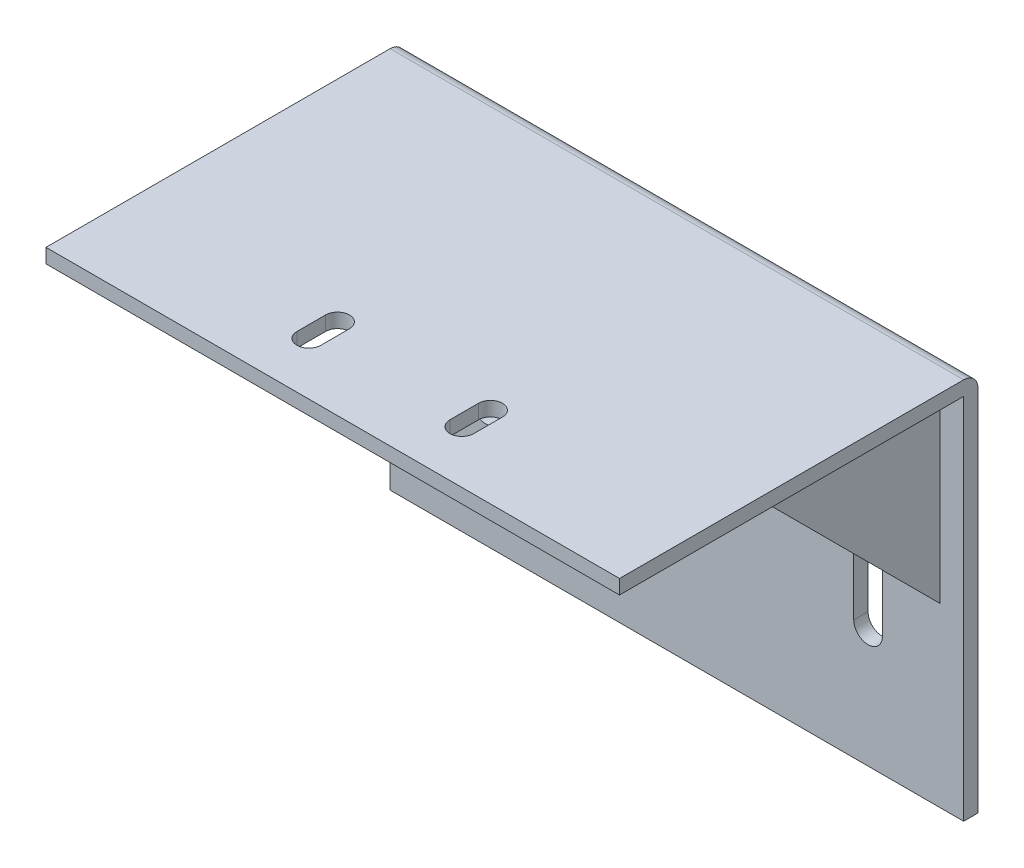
ISO-10303-21;
HEADER;
FILE_DESCRIPTION(('STEP AP214'),'2;1');
FILE_NAME('part.step','',(''),(''),'','','');
FILE_SCHEMA(('AUTOMOTIVE_DESIGN { 1 0 10303 214 1 1 1 1 }'));
ENDSEC;
DATA;
#1=APPLICATION_CONTEXT('core data for automotive mechanical design processes');
#2=APPLICATION_PROTOCOL_DEFINITION('international standard','automotive_design',2000,#1);
#3=PRODUCT_CONTEXT('',#1,'mechanical');
#4=PRODUCT('Part','Part','',(#3));
#5=PRODUCT_RELATED_PRODUCT_CATEGORY('part','',(#4));
#6=PRODUCT_DEFINITION_FORMATION('','',#4);
#7=PRODUCT_DEFINITION_CONTEXT('part definition',#1,'design');
#8=PRODUCT_DEFINITION('design','',#6,#7);
#9=PRODUCT_DEFINITION_SHAPE('','',#8);
#10=(LENGTH_UNIT() NAMED_UNIT(*) SI_UNIT(.MILLI.,.METRE.));
#11=(NAMED_UNIT(*) PLANE_ANGLE_UNIT() SI_UNIT($,.RADIAN.));
#12=(NAMED_UNIT(*) SI_UNIT($,.STERADIAN.) SOLID_ANGLE_UNIT());
#13=UNCERTAINTY_MEASURE_WITH_UNIT(LENGTH_MEASURE(1.E-05),#10,'distance_accuracy_value','');
#14=(GEOMETRIC_REPRESENTATION_CONTEXT(3) GLOBAL_UNCERTAINTY_ASSIGNED_CONTEXT((#13)) GLOBAL_UNIT_ASSIGNED_CONTEXT((#10,
#11,#12)) REPRESENTATION_CONTEXT('',''));
#15=CARTESIAN_POINT('',(0.,0.,0.));
#16=DIRECTION('',(0.,0.,1.));
#17=DIRECTION('',(1.,0.,0.));
#18=AXIS2_PLACEMENT_3D('',#15,#16,#17);
#19=CARTESIAN_POINT('',(0.,0.,3.));
#20=DIRECTION('',(0.,0.,-1.));
#21=DIRECTION('',(-1.,0.,0.));
#22=AXIS2_PLACEMENT_3D('',#19,#20,#21);
#23=PLANE('',#22);
#24=CARTESIAN_POINT('',(20.,25.,3.));
#25=DIRECTION('',(0.,0.,1.));
#26=DIRECTION('',(1.,0.,0.));
#27=AXIS2_PLACEMENT_3D('',#24,#25,#26);
#28=CIRCLE('',#27,3.);
#29=CARTESIAN_POINT('',(17.,25.,3.));
#30=VERTEX_POINT('',#29);
#31=CARTESIAN_POINT('',(23.,25.,3.));
#32=VERTEX_POINT('',#31);
#33=EDGE_CURVE('E279',#30,#32,#28,.T.);
#34=ORIENTED_EDGE('',*,*,#33,.F.);
#35=DIRECTION('',(0.,-1.,0.));
#36=VECTOR('',#35,1.);
#37=CARTESIAN_POINT('',(17.,55.,3.));
#38=LINE('',#37,#36);
#39=CARTESIAN_POINT('',(17.,55.,3.));
#40=VERTEX_POINT('',#39);
#41=EDGE_CURVE('E277',#40,#30,#38,.T.);
#42=ORIENTED_EDGE('',*,*,#41,.F.);
#43=CARTESIAN_POINT('',(20.,55.,3.));
#44=DIRECTION('',(0.,0.,1.));
#45=DIRECTION('',(1.,0.,0.));
#46=AXIS2_PLACEMENT_3D('',#43,#44,#45);
#47=CIRCLE('',#46,2.99999999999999);
#48=CARTESIAN_POINT('',(23.,55.,3.));
#49=VERTEX_POINT('',#48);
#50=EDGE_CURVE('E268',#49,#40,#47,.T.);
#51=ORIENTED_EDGE('',*,*,#50,.F.);
#52=DIRECTION('',(0.,1.,0.));
#53=VECTOR('',#52,1.);
#54=CARTESIAN_POINT('',(23.,55.,3.));
#55=LINE('',#54,#53);
#56=EDGE_CURVE('E282',#32,#49,#55,.T.);
#57=ORIENTED_EDGE('',*,*,#56,.F.);
#58=EDGE_LOOP('',(#34,#42,#51,#57));
#59=FACE_BOUND('',#58,.T.);
#60=CARTESIAN_POINT('',(100.,25.,3.));
#61=DIRECTION('',(0.,0.,1.));
#62=DIRECTION('',(1.,0.,0.));
#63=AXIS2_PLACEMENT_3D('',#60,#61,#62);
#64=CIRCLE('',#63,3.);
#65=CARTESIAN_POINT('',(97.,25.,3.));
#66=VERTEX_POINT('',#65);
#67=CARTESIAN_POINT('',(103.,24.9999999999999,3.));
#68=VERTEX_POINT('',#67);
#69=EDGE_CURVE('E247',#66,#68,#64,.T.);
#70=ORIENTED_EDGE('',*,*,#69,.F.);
#71=DIRECTION('',(0.,-1.,0.));
#72=VECTOR('',#71,1.);
#73=CARTESIAN_POINT('',(97.,55.,3.));
#74=LINE('',#73,#72);
#75=CARTESIAN_POINT('',(97.,55.,3.));
#76=VERTEX_POINT('',#75);
#77=EDGE_CURVE('E245',#76,#66,#74,.T.);
#78=ORIENTED_EDGE('',*,*,#77,.F.);
#79=CARTESIAN_POINT('',(100.,55.,3.));
#80=DIRECTION('',(0.,0.,1.));
#81=DIRECTION('',(1.,0.,0.));
#82=AXIS2_PLACEMENT_3D('',#79,#80,#81);
#83=CIRCLE('',#82,3.);
#84=CARTESIAN_POINT('',(103.,55.,3.));
#85=VERTEX_POINT('',#84);
#86=EDGE_CURVE('E240',#85,#76,#83,.T.);
#87=ORIENTED_EDGE('',*,*,#86,.F.);
#88=DIRECTION('',(0.,1.,0.));
#89=VECTOR('',#88,1.);
#90=CARTESIAN_POINT('',(103.,55.,3.));
#91=LINE('',#90,#89);
#92=EDGE_CURVE('E250',#68,#85,#91,.T.);
#93=ORIENTED_EDGE('',*,*,#92,.F.);
#94=EDGE_LOOP('',(#70,#78,#87,#93));
#95=FACE_BOUND('',#94,.T.);
#96=DIRECTION('',(0.,1.,0.));
#97=VECTOR('',#96,1.);
#98=CARTESIAN_POINT('',(115.,77.,3.));
#99=LINE('',#98,#97);
#100=CARTESIAN_POINT('',(115.,37.,3.));
#101=VERTEX_POINT('',#100);
#102=CARTESIAN_POINT('',(115.,77.,3.));
#103=VERTEX_POINT('',#102);
#104=EDGE_CURVE('E398',#101,#103,#99,.T.);
#105=ORIENTED_EDGE('',*,*,#104,.F.);
#106=DIRECTION('',(1.,0.,0.));
#107=VECTOR('',#106,1.);
#108=CARTESIAN_POINT('',(112.,37.,3.));
#109=LINE('',#108,#107);
#110=CARTESIAN_POINT('',(112.,37.,3.));
#111=VERTEX_POINT('',#110);
#112=EDGE_CURVE('E458',#111,#101,#109,.T.);
#113=ORIENTED_EDGE('',*,*,#112,.F.);
#114=DIRECTION('',(0.,-1.,0.));
#115=VECTOR('',#114,1.);
#116=CARTESIAN_POINT('',(112.,77.,3.));
#117=LINE('',#116,#115);
#118=CARTESIAN_POINT('',(112.,77.,3.));
#119=VERTEX_POINT('',#118);
#120=EDGE_CURVE('E452',#119,#111,#117,.T.);
#121=ORIENTED_EDGE('',*,*,#120,.F.);
#122=DIRECTION('',(1.,0.,0.));
#123=VECTOR('',#122,1.);
#124=CARTESIAN_POINT('',(0.,77.,3.));
#125=LINE('',#124,#123);
#126=CARTESIAN_POINT('',(8.,77.,3.));
#127=VERTEX_POINT('',#126);
#128=EDGE_CURVE('E319',#127,#119,#125,.T.);
#129=ORIENTED_EDGE('',*,*,#128,.F.);
#130=DIRECTION('',(0.,1.,0.));
#131=VECTOR('',#130,1.);
#132=CARTESIAN_POINT('',(8.,77.,3.));
#133=LINE('',#132,#131);
#134=CARTESIAN_POINT('',(8.00000000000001,37.,3.));
#135=VERTEX_POINT('',#134);
#136=EDGE_CURVE('E225',#135,#127,#133,.T.);
#137=ORIENTED_EDGE('',*,*,#136,.F.);
#138=DIRECTION('',(1.,0.,0.));
#139=VECTOR('',#138,1.);
#140=CARTESIAN_POINT('',(4.99999999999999,37.,3.));
#141=LINE('',#140,#139);
#142=CARTESIAN_POINT('',(4.99999999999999,37.,3.));
#143=VERTEX_POINT('',#142);
#144=EDGE_CURVE('E467',#143,#135,#141,.T.);
#145=ORIENTED_EDGE('',*,*,#144,.F.);
#146=DIRECTION('',(0.,-1.,0.));
#147=VECTOR('',#146,1.);
#148=CARTESIAN_POINT('',(4.99999999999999,77.,3.));
#149=LINE('',#148,#147);
#150=CARTESIAN_POINT('',(4.99999999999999,77.,3.));
#151=VERTEX_POINT('',#150);
#152=EDGE_CURVE('E230',#151,#143,#149,.T.);
#153=ORIENTED_EDGE('',*,*,#152,.F.);
#154=CARTESIAN_POINT('',(0.,77.,3.));
#155=VERTEX_POINT('',#154);
#156=EDGE_CURVE('E237',#155,#151,#125,.T.);
#157=ORIENTED_EDGE('',*,*,#156,.F.);
#158=DIRECTION('',(0.,-1.,0.));
#159=VECTOR('',#158,1.);
#160=CARTESIAN_POINT('',(0.,0.,3.));
#161=LINE('',#160,#159);
#162=CARTESIAN_POINT('',(0.,0.,3.));
#163=VERTEX_POINT('',#162);
#164=EDGE_CURVE('E344',#155,#163,#161,.T.);
#165=ORIENTED_EDGE('',*,*,#164,.T.);
#166=DIRECTION('',(1.,0.,0.));
#167=VECTOR('',#166,1.);
#168=CARTESIAN_POINT('',(0.,0.,3.));
#169=LINE('',#168,#167);
#170=CARTESIAN_POINT('',(120.,0.,3.));
#171=VERTEX_POINT('',#170);
#172=EDGE_CURVE('E346',#163,#171,#169,.T.);
#173=ORIENTED_EDGE('',*,*,#172,.T.);
#174=DIRECTION('',(0.,1.,0.));
#175=VECTOR('',#174,1.);
#176=CARTESIAN_POINT('',(120.,0.,3.));
#177=LINE('',#176,#175);
#178=CARTESIAN_POINT('',(120.,77.,3.));
#179=VERTEX_POINT('',#178);
#180=EDGE_CURVE('E348',#171,#179,#177,.T.);
#181=ORIENTED_EDGE('',*,*,#180,.T.);
#182=EDGE_CURVE('E300',#103,#179,#125,.T.);
#183=ORIENTED_EDGE('',*,*,#182,.F.);
#184=EDGE_LOOP('',(#105,#113,#121,#129,#137,#145,#153,#157,#165,#173,#181,#183));
#185=FACE_BOUND('',#184,.T.);
#186=ADVANCED_FACE('F24',(#59,#95,#185),#23,.F.);
#187=CARTESIAN_POINT('',(0.,77.,75.));
#188=DIRECTION('',(0.,1.,0.));
#189=DIRECTION('',(-1.,0.,0.));
#190=AXIS2_PLACEMENT_3D('',#187,#188,#189);
#191=PLANE('',#190);
#192=DIRECTION('',(0.,0.,-1.));
#193=VECTOR('',#192,1.);
#194=CARTESIAN_POINT('',(41.5,77.,64.));
#195=LINE('',#194,#193);
#196=CARTESIAN_POINT('',(41.5,77.,64.));
#197=VERTEX_POINT('',#196);
#198=CARTESIAN_POINT('',(41.5,77.,58.));
#199=VERTEX_POINT('',#198);
#200=EDGE_CURVE('E677',#197,#199,#195,.T.);
#201=ORIENTED_EDGE('',*,*,#200,.F.);
#202=CARTESIAN_POINT('',(44.,77.,64.));
#203=DIRECTION('',(0.,-1.,0.));
#204=DIRECTION('',(1.,0.,0.));
#205=AXIS2_PLACEMENT_3D('',#202,#203,#204);
#206=CIRCLE('',#205,2.5);
#207=CARTESIAN_POINT('',(46.5,77.,64.));
#208=VERTEX_POINT('',#207);
#209=EDGE_CURVE('E674',#208,#197,#206,.T.);
#210=ORIENTED_EDGE('',*,*,#209,.F.);
#211=DIRECTION('',(0.,0.,1.));
#212=VECTOR('',#211,1.);
#213=CARTESIAN_POINT('',(46.5,77.,64.));
#214=LINE('',#213,#212);
#215=CARTESIAN_POINT('',(46.5,77.,58.));
#216=VERTEX_POINT('',#215);
#217=EDGE_CURVE('E663',#216,#208,#214,.T.);
#218=ORIENTED_EDGE('',*,*,#217,.F.);
#219=CARTESIAN_POINT('',(44.,77.,58.));
#220=DIRECTION('',(0.,-1.,0.));
#221=DIRECTION('',(1.,0.,0.));
#222=AXIS2_PLACEMENT_3D('',#219,#220,#221);
#223=CIRCLE('',#222,2.5);
#224=EDGE_CURVE('E671',#199,#216,#223,.T.);
#225=ORIENTED_EDGE('',*,*,#224,.F.);
#226=EDGE_LOOP('',(#201,#210,#218,#225));
#227=FACE_BOUND('',#226,.T.);
#228=DIRECTION('',(0.,0.,-1.));
#229=VECTOR('',#228,1.);
#230=CARTESIAN_POINT('',(73.5,77.,64.));
#231=LINE('',#230,#229);
#232=CARTESIAN_POINT('',(73.5,77.,64.));
#233=VERTEX_POINT('',#232);
#234=CARTESIAN_POINT('',(73.5,77.,58.));
#235=VERTEX_POINT('',#234);
#236=EDGE_CURVE('E700',#233,#235,#231,.T.);
#237=ORIENTED_EDGE('',*,*,#236,.F.);
#238=CARTESIAN_POINT('',(76.,77.,64.));
#239=DIRECTION('',(0.,-1.,0.));
#240=DIRECTION('',(1.,0.,0.));
#241=AXIS2_PLACEMENT_3D('',#238,#239,#240);
#242=CIRCLE('',#241,2.50000000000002);
#243=CARTESIAN_POINT('',(78.5,77.,64.));
#244=VERTEX_POINT('',#243);
#245=EDGE_CURVE('E694',#244,#233,#242,.T.);
#246=ORIENTED_EDGE('',*,*,#245,.F.);
#247=DIRECTION('',(0.,0.,1.));
#248=VECTOR('',#247,1.);
#249=CARTESIAN_POINT('',(78.5,77.,64.));
#250=LINE('',#249,#248);
#251=CARTESIAN_POINT('',(78.5,77.,58.));
#252=VERTEX_POINT('',#251);
#253=EDGE_CURVE('E705',#252,#244,#250,.T.);
#254=ORIENTED_EDGE('',*,*,#253,.F.);
#255=CARTESIAN_POINT('',(76.,77.,58.));
#256=DIRECTION('',(0.,-1.,0.));
#257=DIRECTION('',(1.,0.,0.));
#258=AXIS2_PLACEMENT_3D('',#255,#256,#257);
#259=CIRCLE('',#258,2.50000000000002);
#260=EDGE_CURVE('E703',#235,#252,#259,.T.);
#261=ORIENTED_EDGE('',*,*,#260,.F.);
#262=EDGE_LOOP('',(#237,#246,#254,#261));
#263=FACE_BOUND('',#262,.T.);
#264=DIRECTION('',(-1.,0.,0.));
#265=VECTOR('',#264,1.);
#266=CARTESIAN_POINT('',(4.99999999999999,77.,43.));
#267=LINE('',#266,#265);
#268=CARTESIAN_POINT('',(8.,77.,43.));
#269=VERTEX_POINT('',#268);
#270=CARTESIAN_POINT('',(4.99999999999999,77.,43.));
#271=VERTEX_POINT('',#270);
#272=EDGE_CURVE('E213',#269,#271,#267,.T.);
#273=ORIENTED_EDGE('',*,*,#272,.F.);
#274=DIRECTION('',(0.,0.,-1.));
#275=VECTOR('',#274,1.);
#276=CARTESIAN_POINT('',(8.,77.,43.));
#277=LINE('',#276,#275);
#278=EDGE_CURVE('E238',#269,#127,#277,.T.);
#279=ORIENTED_EDGE('',*,*,#278,.T.);
#280=ORIENTED_EDGE('',*,*,#128,.T.);
#281=DIRECTION('',(0.,0.,-1.));
#282=VECTOR('',#281,1.);
#283=CARTESIAN_POINT('',(112.,77.,43.));
#284=LINE('',#283,#282);
#285=CARTESIAN_POINT('',(112.,77.,43.));
#286=VERTEX_POINT('',#285);
#287=EDGE_CURVE('E463',#286,#119,#284,.T.);
#288=ORIENTED_EDGE('',*,*,#287,.F.);
#289=DIRECTION('',(-1.,0.,0.));
#290=VECTOR('',#289,1.);
#291=CARTESIAN_POINT('',(112.,77.,43.));
#292=LINE('',#291,#290);
#293=CARTESIAN_POINT('',(115.,77.,43.));
#294=VERTEX_POINT('',#293);
#295=EDGE_CURVE('E461',#294,#286,#292,.T.);
#296=ORIENTED_EDGE('',*,*,#295,.F.);
#297=DIRECTION('',(0.,0.,-1.));
#298=VECTOR('',#297,1.);
#299=CARTESIAN_POINT('',(115.,77.,43.));
#300=LINE('',#299,#298);
#301=EDGE_CURVE('E394',#294,#103,#300,.T.);
#302=ORIENTED_EDGE('',*,*,#301,.T.);
#303=ORIENTED_EDGE('',*,*,#182,.T.);
#304=DIRECTION('',(0.,0.,-1.));
#305=VECTOR('',#304,1.);
#306=CARTESIAN_POINT('',(120.,77.,75.));
#307=LINE('',#306,#305);
#308=CARTESIAN_POINT('',(120.,77.,75.));
#309=VERTEX_POINT('',#308);
#310=EDGE_CURVE('E377',#309,#179,#307,.T.);
#311=ORIENTED_EDGE('',*,*,#310,.F.);
#312=DIRECTION('',(1.,0.,0.));
#313=VECTOR('',#312,1.);
#314=CARTESIAN_POINT('',(0.,77.,75.));
#315=LINE('',#314,#313);
#316=CARTESIAN_POINT('',(0.,77.,75.));
#317=VERTEX_POINT('',#316);
#318=EDGE_CURVE('E379',#317,#309,#315,.T.);
#319=ORIENTED_EDGE('',*,*,#318,.F.);
#320=DIRECTION('',(0.,0.,-1.));
#321=VECTOR('',#320,1.);
#322=CARTESIAN_POINT('',(0.,77.,75.));
#323=LINE('',#322,#321);
#324=EDGE_CURVE('E373',#317,#155,#323,.T.);
#325=ORIENTED_EDGE('',*,*,#324,.T.);
#326=ORIENTED_EDGE('',*,*,#156,.T.);
#327=DIRECTION('',(0.,0.,-1.));
#328=VECTOR('',#327,1.);
#329=CARTESIAN_POINT('',(4.99999999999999,77.,43.));
#330=LINE('',#329,#328);
#331=EDGE_CURVE('E224',#271,#151,#330,.T.);
#332=ORIENTED_EDGE('',*,*,#331,.F.);
#333=EDGE_LOOP('',(#273,#279,#280,#288,#296,#302,#303,#311,#319,#325,#326,#332));
#334=FACE_BOUND('',#333,.T.);
#335=ADVANCED_FACE('F235',(#227,#263,#334),#191,.F.);
#336=CARTESIAN_POINT('',(0.,0.,3.));
#337=DIRECTION('',(1.,0.,0.));
#338=DIRECTION('',(0.,0.,-1.));
#339=AXIS2_PLACEMENT_3D('',#336,#337,#338);
#340=PLANE('',#339);
#341=DIRECTION('',(0.,0.,-1.));
#342=VECTOR('',#341,1.);
#343=CARTESIAN_POINT('',(0.,80.,3.));
#344=LINE('',#343,#342);
#345=CARTESIAN_POINT('',(0.,80.,75.));
#346=VERTEX_POINT('',#345);
#347=CARTESIAN_POINT('',(0.,80.,3.));
#348=VERTEX_POINT('',#347);
#349=EDGE_CURVE('E356',#346,#348,#344,.T.);
#350=ORIENTED_EDGE('',*,*,#349,.T.);
#351=CARTESIAN_POINT('',(0.,77.,3.));
#352=DIRECTION('',(1.,0.,0.));
#353=DIRECTION('',(0.,0.,-1.));
#354=AXIS2_PLACEMENT_3D('',#351,#352,#353);
#355=CIRCLE('',#354,3.);
#356=CARTESIAN_POINT('',(0.,77.,0.));
#357=VERTEX_POINT('',#356);
#358=EDGE_CURVE('E46',#348,#357,#355,.F.);
#359=ORIENTED_EDGE('',*,*,#358,.T.);
#360=DIRECTION('',(0.,-1.,0.));
#361=VECTOR('',#360,1.);
#362=CARTESIAN_POINT('',(0.,0.,0.));
#363=LINE('',#362,#361);
#364=CARTESIAN_POINT('',(0.,0.,0.));
#365=VERTEX_POINT('',#364);
#366=EDGE_CURVE('E372',#357,#365,#363,.T.);
#367=ORIENTED_EDGE('',*,*,#366,.T.);
#368=DIRECTION('',(0.,0.,-1.));
#369=VECTOR('',#368,1.);
#370=CARTESIAN_POINT('',(0.,0.,3.));
#371=LINE('',#370,#369);
#372=EDGE_CURVE('E329',#163,#365,#371,.T.);
#373=ORIENTED_EDGE('',*,*,#372,.F.);
#374=ORIENTED_EDGE('',*,*,#164,.F.);
#375=ORIENTED_EDGE('',*,*,#324,.F.);
#376=DIRECTION('',(0.,-1.,0.));
#377=VECTOR('',#376,1.);
#378=CARTESIAN_POINT('',(0.,80.,75.));
#379=LINE('',#378,#377);
#380=EDGE_CURVE('E310',#346,#317,#379,.T.);
#381=ORIENTED_EDGE('',*,*,#380,.F.);
#382=EDGE_LOOP('',(#350,#359,#367,#373,#374,#375,#381));
#383=FACE_BOUND('',#382,.T.);
#384=ADVANCED_FACE('F26',(#383),#340,.F.);
#385=CARTESIAN_POINT('',(0.,0.,3.));
#386=DIRECTION('',(0.,1.,0.));
#387=DIRECTION('',(0.,0.,1.));
#388=AXIS2_PLACEMENT_3D('',#385,#386,#387);
#389=PLANE('',#388);
#390=DIRECTION('',(1.,0.,0.));
#391=VECTOR('',#390,1.);
#392=CARTESIAN_POINT('',(0.,0.,0.));
#393=LINE('',#392,#391);
#394=CARTESIAN_POINT('',(120.,0.,0.));
#395=VERTEX_POINT('',#394);
#396=EDGE_CURVE('E371',#365,#395,#393,.T.);
#397=ORIENTED_EDGE('',*,*,#396,.T.);
#398=DIRECTION('',(0.,0.,-1.));
#399=VECTOR('',#398,1.);
#400=CARTESIAN_POINT('',(120.,0.,3.));
#401=LINE('',#400,#399);
#402=EDGE_CURVE('E334',#171,#395,#401,.T.);
#403=ORIENTED_EDGE('',*,*,#402,.F.);
#404=ORIENTED_EDGE('',*,*,#172,.F.);
#405=ORIENTED_EDGE('',*,*,#372,.T.);
#406=EDGE_LOOP('',(#397,#403,#404,#405));
#407=FACE_BOUND('',#406,.T.);
#408=ADVANCED_FACE('F399',(#407),#389,.F.);
#409=CARTESIAN_POINT('',(120.,0.,3.));
#410=DIRECTION('',(-1.,0.,0.));
#411=DIRECTION('',(0.,0.,1.));
#412=AXIS2_PLACEMENT_3D('',#409,#410,#411);
#413=PLANE('',#412);
#414=DIRECTION('',(0.,1.,0.));
#415=VECTOR('',#414,1.);
#416=CARTESIAN_POINT('',(120.,0.,0.));
#417=LINE('',#416,#415);
#418=CARTESIAN_POINT('',(120.,77.,0.));
#419=VERTEX_POINT('',#418);
#420=EDGE_CURVE('E347',#395,#419,#417,.T.);
#421=ORIENTED_EDGE('',*,*,#420,.T.);
#422=CARTESIAN_POINT('',(120.,77.,3.));
#423=DIRECTION('',(-1.,0.,0.));
#424=DIRECTION('',(0.,0.,1.));
#425=AXIS2_PLACEMENT_3D('',#422,#423,#424);
#426=CIRCLE('',#425,3.);
#427=CARTESIAN_POINT('',(120.,80.,3.));
#428=VERTEX_POINT('',#427);
#429=EDGE_CURVE('E11',#419,#428,#426,.F.);
#430=ORIENTED_EDGE('',*,*,#429,.T.);
#431=DIRECTION('',(0.,0.,-1.));
#432=VECTOR('',#431,1.);
#433=CARTESIAN_POINT('',(120.,80.,3.));
#434=LINE('',#433,#432);
#435=CARTESIAN_POINT('',(120.,80.,75.));
#436=VERTEX_POINT('',#435);
#437=EDGE_CURVE('E340',#436,#428,#434,.T.);
#438=ORIENTED_EDGE('',*,*,#437,.F.);
#439=DIRECTION('',(0.,1.,0.));
#440=VECTOR('',#439,1.);
#441=CARTESIAN_POINT('',(120.,80.,75.));
#442=LINE('',#441,#440);
#443=EDGE_CURVE('E378',#309,#436,#442,.T.);
#444=ORIENTED_EDGE('',*,*,#443,.F.);
#445=ORIENTED_EDGE('',*,*,#310,.T.);
#446=ORIENTED_EDGE('',*,*,#180,.F.);
#447=ORIENTED_EDGE('',*,*,#402,.T.);
#448=EDGE_LOOP('',(#421,#430,#438,#444,#445,#446,#447));
#449=FACE_BOUND('',#448,.T.);
#450=ADVANCED_FACE('F367',(#449),#413,.F.);
#451=CARTESIAN_POINT('',(0.,80.,3.));
#452=DIRECTION('',(0.,-1.,0.));
#453=DIRECTION('',(1.,0.,0.));
#454=AXIS2_PLACEMENT_3D('',#451,#452,#453);
#455=PLANE('',#454);
#456=DIRECTION('',(0.,0.,1.));
#457=VECTOR('',#456,1.);
#458=CARTESIAN_POINT('',(46.5,80.,64.));
#459=LINE('',#458,#457);
#460=CARTESIAN_POINT('',(46.5,80.,58.));
#461=VERTEX_POINT('',#460);
#462=CARTESIAN_POINT('',(46.5,80.,64.));
#463=VERTEX_POINT('',#462);
#464=EDGE_CURVE('E430',#461,#463,#459,.T.);
#465=ORIENTED_EDGE('',*,*,#464,.T.);
#466=CARTESIAN_POINT('',(44.,80.,64.));
#467=DIRECTION('',(0.,-1.,0.));
#468=DIRECTION('',(1.,0.,0.));
#469=AXIS2_PLACEMENT_3D('',#466,#467,#468);
#470=CIRCLE('',#469,2.5);
#471=CARTESIAN_POINT('',(41.5,80.,64.));
#472=VERTEX_POINT('',#471);
#473=EDGE_CURVE('E670',#463,#472,#470,.T.);
#474=ORIENTED_EDGE('',*,*,#473,.T.);
#475=DIRECTION('',(0.,0.,-1.));
#476=VECTOR('',#475,1.);
#477=CARTESIAN_POINT('',(41.5,80.,64.));
#478=LINE('',#477,#476);
#479=CARTESIAN_POINT('',(41.5,80.,58.));
#480=VERTEX_POINT('',#479);
#481=EDGE_CURVE('E686',#472,#480,#478,.T.);
#482=ORIENTED_EDGE('',*,*,#481,.T.);
#483=CARTESIAN_POINT('',(44.,80.,58.));
#484=DIRECTION('',(0.,-1.,0.));
#485=DIRECTION('',(1.,0.,0.));
#486=AXIS2_PLACEMENT_3D('',#483,#484,#485);
#487=CIRCLE('',#486,2.5);
#488=EDGE_CURVE('E689',#480,#461,#487,.T.);
#489=ORIENTED_EDGE('',*,*,#488,.T.);
#490=EDGE_LOOP('',(#465,#474,#482,#489));
#491=FACE_BOUND('',#490,.T.);
#492=DIRECTION('',(0.,0.,1.));
#493=VECTOR('',#492,1.);
#494=CARTESIAN_POINT('',(78.5,80.,64.));
#495=LINE('',#494,#493);
#496=CARTESIAN_POINT('',(78.5,80.,58.));
#497=VERTEX_POINT('',#496);
#498=CARTESIAN_POINT('',(78.5,80.,64.));
#499=VERTEX_POINT('',#498);
#500=EDGE_CURVE('E435',#497,#499,#495,.T.);
#501=ORIENTED_EDGE('',*,*,#500,.T.);
#502=CARTESIAN_POINT('',(76.,80.,64.));
#503=DIRECTION('',(0.,-1.,0.));
#504=DIRECTION('',(1.,0.,0.));
#505=AXIS2_PLACEMENT_3D('',#502,#503,#504);
#506=CIRCLE('',#505,2.50000000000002);
#507=CARTESIAN_POINT('',(73.5,80.,64.));
#508=VERTEX_POINT('',#507);
#509=EDGE_CURVE('E438',#499,#508,#506,.T.);
#510=ORIENTED_EDGE('',*,*,#509,.T.);
#511=DIRECTION('',(0.,0.,-1.));
#512=VECTOR('',#511,1.);
#513=CARTESIAN_POINT('',(73.5,80.,64.));
#514=LINE('',#513,#512);
#515=CARTESIAN_POINT('',(73.5,80.,58.));
#516=VERTEX_POINT('',#515);
#517=EDGE_CURVE('E446',#508,#516,#514,.T.);
#518=ORIENTED_EDGE('',*,*,#517,.T.);
#519=CARTESIAN_POINT('',(76.,80.,58.));
#520=DIRECTION('',(0.,-1.,0.));
#521=DIRECTION('',(1.,0.,0.));
#522=AXIS2_PLACEMENT_3D('',#519,#520,#521);
#523=CIRCLE('',#522,2.50000000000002);
#524=EDGE_CURVE('E439',#516,#497,#523,.T.);
#525=ORIENTED_EDGE('',*,*,#524,.T.);
#526=EDGE_LOOP('',(#501,#510,#518,#525));
#527=FACE_BOUND('',#526,.T.);
#528=ORIENTED_EDGE('',*,*,#437,.T.);
#529=DIRECTION('',(-1.,0.,0.));
#530=VECTOR('',#529,1.);
#531=CARTESIAN_POINT('',(0.,80.,3.));
#532=LINE('',#531,#530);
#533=EDGE_CURVE('E326',#428,#348,#532,.T.);
#534=ORIENTED_EDGE('',*,*,#533,.T.);
#535=ORIENTED_EDGE('',*,*,#349,.F.);
#536=DIRECTION('',(-1.,0.,0.));
#537=VECTOR('',#536,1.);
#538=CARTESIAN_POINT('',(0.,80.,75.));
#539=LINE('',#538,#537);
#540=EDGE_CURVE('E360',#436,#346,#539,.T.);
#541=ORIENTED_EDGE('',*,*,#540,.F.);
#542=EDGE_LOOP('',(#528,#534,#535,#541));
#543=FACE_BOUND('',#542,.T.);
#544=ADVANCED_FACE('F358',(#491,#527,#543),#455,.F.);
#545=CARTESIAN_POINT('',(0.,0.,0.));
#546=DIRECTION('',(0.,0.,-1.));
#547=DIRECTION('',(-1.,0.,0.));
#548=AXIS2_PLACEMENT_3D('',#545,#546,#547);
#549=PLANE('',#548);
#550=CARTESIAN_POINT('',(100.,55.,0.));
#551=DIRECTION('',(0.,0.,1.));
#552=DIRECTION('',(1.,0.,0.));
#553=AXIS2_PLACEMENT_3D('',#550,#551,#552);
#554=CIRCLE('',#553,3.);
#555=CARTESIAN_POINT('',(103.,55.,0.));
#556=VERTEX_POINT('',#555);
#557=CARTESIAN_POINT('',(97.,55.,0.));
#558=VERTEX_POINT('',#557);
#559=EDGE_CURVE('E252',#556,#558,#554,.T.);
#560=ORIENTED_EDGE('',*,*,#559,.T.);
#561=DIRECTION('',(0.,-1.,0.));
#562=VECTOR('',#561,1.);
#563=CARTESIAN_POINT('',(97.,55.,0.));
#564=LINE('',#563,#562);
#565=CARTESIAN_POINT('',(97.,25.,0.));
#566=VERTEX_POINT('',#565);
#567=EDGE_CURVE('E255',#558,#566,#564,.T.);
#568=ORIENTED_EDGE('',*,*,#567,.T.);
#569=CARTESIAN_POINT('',(100.,25.,0.));
#570=DIRECTION('',(0.,0.,1.));
#571=DIRECTION('',(1.,0.,0.));
#572=AXIS2_PLACEMENT_3D('',#569,#570,#571);
#573=CIRCLE('',#572,3.);
#574=CARTESIAN_POINT('',(103.,24.9999999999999,0.));
#575=VERTEX_POINT('',#574);
#576=EDGE_CURVE('E258',#566,#575,#573,.T.);
#577=ORIENTED_EDGE('',*,*,#576,.T.);
#578=DIRECTION('',(0.,1.,0.));
#579=VECTOR('',#578,1.);
#580=CARTESIAN_POINT('',(103.,55.,0.));
#581=LINE('',#580,#579);
#582=EDGE_CURVE('E261',#575,#556,#581,.T.);
#583=ORIENTED_EDGE('',*,*,#582,.T.);
#584=EDGE_LOOP('',(#560,#568,#577,#583));
#585=FACE_BOUND('',#584,.T.);
#586=CARTESIAN_POINT('',(20.,55.,0.));
#587=DIRECTION('',(0.,0.,1.));
#588=DIRECTION('',(1.,0.,0.));
#589=AXIS2_PLACEMENT_3D('',#586,#587,#588);
#590=CIRCLE('',#589,2.99999999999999);
#591=CARTESIAN_POINT('',(23.,55.,0.));
#592=VERTEX_POINT('',#591);
#593=CARTESIAN_POINT('',(17.,55.,0.));
#594=VERTEX_POINT('',#593);
#595=EDGE_CURVE('E284',#592,#594,#590,.T.);
#596=ORIENTED_EDGE('',*,*,#595,.T.);
#597=DIRECTION('',(0.,-1.,0.));
#598=VECTOR('',#597,1.);
#599=CARTESIAN_POINT('',(17.,55.,0.));
#600=LINE('',#599,#598);
#601=CARTESIAN_POINT('',(17.,25.,0.));
#602=VERTEX_POINT('',#601);
#603=EDGE_CURVE('E287',#594,#602,#600,.T.);
#604=ORIENTED_EDGE('',*,*,#603,.T.);
#605=CARTESIAN_POINT('',(20.,25.,0.));
#606=DIRECTION('',(0.,0.,1.));
#607=DIRECTION('',(1.,0.,0.));
#608=AXIS2_PLACEMENT_3D('',#605,#606,#607);
#609=CIRCLE('',#608,3.);
#610=CARTESIAN_POINT('',(23.,25.,0.));
#611=VERTEX_POINT('',#610);
#612=EDGE_CURVE('E290',#602,#611,#609,.T.);
#613=ORIENTED_EDGE('',*,*,#612,.T.);
#614=DIRECTION('',(0.,1.,0.));
#615=VECTOR('',#614,1.);
#616=CARTESIAN_POINT('',(23.,55.,0.));
#617=LINE('',#616,#615);
#618=EDGE_CURVE('E293',#611,#592,#617,.T.);
#619=ORIENTED_EDGE('',*,*,#618,.T.);
#620=EDGE_LOOP('',(#596,#604,#613,#619));
#621=FACE_BOUND('',#620,.T.);
#622=ORIENTED_EDGE('',*,*,#366,.F.);
#623=DIRECTION('',(-1.,0.,0.));
#624=VECTOR('',#623,1.);
#625=CARTESIAN_POINT('',(120.,77.,0.));
#626=LINE('',#625,#624);
#627=EDGE_CURVE('E32',#357,#419,#626,.F.);
#628=ORIENTED_EDGE('',*,*,#627,.T.);
#629=ORIENTED_EDGE('',*,*,#420,.F.);
#630=ORIENTED_EDGE('',*,*,#396,.F.);
#631=EDGE_LOOP('',(#622,#628,#629,#630));
#632=FACE_BOUND('',#631,.T.);
#633=ADVANCED_FACE('F418',(#585,#621,#632),#549,.T.);
#634=CARTESIAN_POINT('',(0.,80.,75.));
#635=DIRECTION('',(0.,0.,1.));
#636=DIRECTION('',(1.,0.,0.));
#637=AXIS2_PLACEMENT_3D('',#634,#635,#636);
#638=PLANE('',#637);
#639=ORIENTED_EDGE('',*,*,#380,.T.);
#640=ORIENTED_EDGE('',*,*,#318,.T.);
#641=ORIENTED_EDGE('',*,*,#443,.T.);
#642=ORIENTED_EDGE('',*,*,#540,.T.);
#643=EDGE_LOOP('',(#639,#640,#641,#642));
#644=FACE_BOUND('',#643,.T.);
#645=ADVANCED_FACE('F385',(#644),#638,.T.);
#646=CARTESIAN_POINT('',(20.,55.,0.));
#647=DIRECTION('',(0.,0.,1.));
#648=DIRECTION('',(1.,0.,0.));
#649=AXIS2_PLACEMENT_3D('',#646,#647,#648);
#650=CYLINDRICAL_SURFACE('',#649,2.99999999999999);
#651=ORIENTED_EDGE('',*,*,#50,.T.);
#652=DIRECTION('',(0.,0.,1.));
#653=VECTOR('',#652,1.);
#654=CARTESIAN_POINT('',(17.,55.,0.));
#655=LINE('',#654,#653);
#656=EDGE_CURVE('E296',#594,#40,#655,.T.);
#657=ORIENTED_EDGE('',*,*,#656,.F.);
#658=ORIENTED_EDGE('',*,*,#595,.F.);
#659=DIRECTION('',(0.,0.,1.));
#660=VECTOR('',#659,1.);
#661=CARTESIAN_POINT('',(23.,55.,0.));
#662=LINE('',#661,#660);
#663=EDGE_CURVE('E297',#592,#49,#662,.T.);
#664=ORIENTED_EDGE('',*,*,#663,.T.);
#665=EDGE_LOOP('',(#651,#657,#658,#664));
#666=FACE_BOUND('',#665,.T.);
#667=ADVANCED_FACE('F522',(#666),#650,.F.);
#668=CARTESIAN_POINT('',(23.,55.,0.));
#669=DIRECTION('',(1.,0.,0.));
#670=DIRECTION('',(0.,1.,0.));
#671=AXIS2_PLACEMENT_3D('',#668,#669,#670);
#672=PLANE('',#671);
#673=ORIENTED_EDGE('',*,*,#56,.T.);
#674=ORIENTED_EDGE('',*,*,#663,.F.);
#675=ORIENTED_EDGE('',*,*,#618,.F.);
#676=DIRECTION('',(0.,0.,1.));
#677=VECTOR('',#676,1.);
#678=CARTESIAN_POINT('',(23.,25.,0.));
#679=LINE('',#678,#677);
#680=EDGE_CURVE('E301',#611,#32,#679,.T.);
#681=ORIENTED_EDGE('',*,*,#680,.T.);
#682=EDGE_LOOP('',(#673,#674,#675,#681));
#683=FACE_BOUND('',#682,.T.);
#684=ADVANCED_FACE('F518',(#683),#672,.F.);
#685=CARTESIAN_POINT('',(20.,25.,0.));
#686=DIRECTION('',(0.,0.,1.));
#687=DIRECTION('',(1.,0.,0.));
#688=AXIS2_PLACEMENT_3D('',#685,#686,#687);
#689=CYLINDRICAL_SURFACE('',#688,3.);
#690=ORIENTED_EDGE('',*,*,#33,.T.);
#691=ORIENTED_EDGE('',*,*,#680,.F.);
#692=ORIENTED_EDGE('',*,*,#612,.F.);
#693=DIRECTION('',(0.,0.,1.));
#694=VECTOR('',#693,1.);
#695=CARTESIAN_POINT('',(17.,25.,0.));
#696=LINE('',#695,#694);
#697=EDGE_CURVE('E303',#602,#30,#696,.T.);
#698=ORIENTED_EDGE('',*,*,#697,.T.);
#699=EDGE_LOOP('',(#690,#691,#692,#698));
#700=FACE_BOUND('',#699,.T.);
#701=ADVANCED_FACE('F521',(#700),#689,.F.);
#702=CARTESIAN_POINT('',(17.,55.,0.));
#703=DIRECTION('',(-1.,0.,0.));
#704=DIRECTION('',(0.,-1.,0.));
#705=AXIS2_PLACEMENT_3D('',#702,#703,#704);
#706=PLANE('',#705);
#707=ORIENTED_EDGE('',*,*,#41,.T.);
#708=ORIENTED_EDGE('',*,*,#697,.F.);
#709=ORIENTED_EDGE('',*,*,#603,.F.);
#710=ORIENTED_EDGE('',*,*,#656,.T.);
#711=EDGE_LOOP('',(#707,#708,#709,#710));
#712=FACE_BOUND('',#711,.T.);
#713=ADVANCED_FACE('F516',(#712),#706,.F.);
#714=CARTESIAN_POINT('',(100.,55.,0.));
#715=DIRECTION('',(0.,0.,1.));
#716=DIRECTION('',(1.,0.,0.));
#717=AXIS2_PLACEMENT_3D('',#714,#715,#716);
#718=CYLINDRICAL_SURFACE('',#717,3.);
#719=ORIENTED_EDGE('',*,*,#86,.T.);
#720=DIRECTION('',(0.,0.,1.));
#721=VECTOR('',#720,1.);
#722=CARTESIAN_POINT('',(97.,55.,0.));
#723=LINE('',#722,#721);
#724=EDGE_CURVE('E264',#558,#76,#723,.T.);
#725=ORIENTED_EDGE('',*,*,#724,.F.);
#726=ORIENTED_EDGE('',*,*,#559,.F.);
#727=DIRECTION('',(0.,0.,1.));
#728=VECTOR('',#727,1.);
#729=CARTESIAN_POINT('',(103.,55.,0.));
#730=LINE('',#729,#728);
#731=EDGE_CURVE('E265',#556,#85,#730,.T.);
#732=ORIENTED_EDGE('',*,*,#731,.T.);
#733=EDGE_LOOP('',(#719,#725,#726,#732));
#734=FACE_BOUND('',#733,.T.);
#735=ADVANCED_FACE('F506',(#734),#718,.F.);
#736=CARTESIAN_POINT('',(103.,55.,0.));
#737=DIRECTION('',(1.,0.,0.));
#738=DIRECTION('',(0.,0.,-1.));
#739=AXIS2_PLACEMENT_3D('',#736,#737,#738);
#740=PLANE('',#739);
#741=ORIENTED_EDGE('',*,*,#92,.T.);
#742=ORIENTED_EDGE('',*,*,#731,.F.);
#743=ORIENTED_EDGE('',*,*,#582,.F.);
#744=DIRECTION('',(0.,0.,1.));
#745=VECTOR('',#744,1.);
#746=CARTESIAN_POINT('',(103.,24.9999999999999,0.));
#747=LINE('',#746,#745);
#748=EDGE_CURVE('E269',#575,#68,#747,.T.);
#749=ORIENTED_EDGE('',*,*,#748,.T.);
#750=EDGE_LOOP('',(#741,#742,#743,#749));
#751=FACE_BOUND('',#750,.T.);
#752=ADVANCED_FACE('F502',(#751),#740,.F.);
#753=CARTESIAN_POINT('',(100.,25.,0.));
#754=DIRECTION('',(0.,0.,1.));
#755=DIRECTION('',(1.,0.,0.));
#756=AXIS2_PLACEMENT_3D('',#753,#754,#755);
#757=CYLINDRICAL_SURFACE('',#756,3.);
#758=ORIENTED_EDGE('',*,*,#69,.T.);
#759=ORIENTED_EDGE('',*,*,#748,.F.);
#760=ORIENTED_EDGE('',*,*,#576,.F.);
#761=DIRECTION('',(0.,0.,1.));
#762=VECTOR('',#761,1.);
#763=CARTESIAN_POINT('',(97.,25.,0.));
#764=LINE('',#763,#762);
#765=EDGE_CURVE('E271',#566,#66,#764,.T.);
#766=ORIENTED_EDGE('',*,*,#765,.T.);
#767=EDGE_LOOP('',(#758,#759,#760,#766));
#768=FACE_BOUND('',#767,.T.);
#769=ADVANCED_FACE('F505',(#768),#757,.F.);
#770=CARTESIAN_POINT('',(97.,55.,0.));
#771=DIRECTION('',(-1.,0.,0.));
#772=DIRECTION('',(0.,0.,1.));
#773=AXIS2_PLACEMENT_3D('',#770,#771,#772);
#774=PLANE('',#773);
#775=ORIENTED_EDGE('',*,*,#77,.T.);
#776=ORIENTED_EDGE('',*,*,#765,.F.);
#777=ORIENTED_EDGE('',*,*,#567,.F.);
#778=ORIENTED_EDGE('',*,*,#724,.T.);
#779=EDGE_LOOP('',(#775,#776,#777,#778));
#780=FACE_BOUND('',#779,.T.);
#781=ADVANCED_FACE('F501',(#780),#774,.F.);
#782=CARTESIAN_POINT('',(4.99999999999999,77.,43.));
#783=DIRECTION('',(1.,0.,0.));
#784=DIRECTION('',(0.,0.,-1.));
#785=AXIS2_PLACEMENT_3D('',#782,#783,#784);
#786=PLANE('',#785);
#787=ORIENTED_EDGE('',*,*,#152,.T.);
#788=DIRECTION('',(0.,-0.707106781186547,-0.707106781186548));
#789=VECTOR('',#788,1.);
#790=CARTESIAN_POINT('',(4.99999999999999,37.,3.));
#791=LINE('',#790,#789);
#792=EDGE_CURVE('E216',#271,#143,#791,.T.);
#793=ORIENTED_EDGE('',*,*,#792,.F.);
#794=ORIENTED_EDGE('',*,*,#331,.T.);
#795=EDGE_LOOP('',(#787,#793,#794));
#796=FACE_BOUND('',#795,.T.);
#797=ADVANCED_FACE('F228',(#796),#786,.F.);
#798=CARTESIAN_POINT('',(8.,77.,43.));
#799=DIRECTION('',(-1.,0.,0.));
#800=DIRECTION('',(0.,-1.,0.));
#801=AXIS2_PLACEMENT_3D('',#798,#799,#800);
#802=PLANE('',#801);
#803=ORIENTED_EDGE('',*,*,#278,.F.);
#804=DIRECTION('',(0.,-0.707106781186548,-0.707106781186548));
#805=VECTOR('',#804,1.);
#806=CARTESIAN_POINT('',(8.,77.,43.));
#807=LINE('',#806,#805);
#808=EDGE_CURVE('E219',#269,#135,#807,.T.);
#809=ORIENTED_EDGE('',*,*,#808,.T.);
#810=ORIENTED_EDGE('',*,*,#136,.T.);
#811=EDGE_LOOP('',(#803,#809,#810));
#812=FACE_BOUND('',#811,.T.);
#813=ADVANCED_FACE('F470',(#812),#802,.F.);
#814=CARTESIAN_POINT('',(112.,77.,43.));
#815=DIRECTION('',(1.,0.,0.));
#816=DIRECTION('',(0.,0.,-1.));
#817=AXIS2_PLACEMENT_3D('',#814,#815,#816);
#818=PLANE('',#817);
#819=ORIENTED_EDGE('',*,*,#120,.T.);
#820=DIRECTION('',(0.,0.707106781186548,0.707106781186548));
#821=VECTOR('',#820,1.);
#822=CARTESIAN_POINT('',(112.,77.,43.));
#823=LINE('',#822,#821);
#824=EDGE_CURVE('E477',#111,#286,#823,.T.);
#825=ORIENTED_EDGE('',*,*,#824,.T.);
#826=ORIENTED_EDGE('',*,*,#287,.T.);
#827=EDGE_LOOP('',(#819,#825,#826));
#828=FACE_BOUND('',#827,.T.);
#829=ADVANCED_FACE('F476',(#828),#818,.F.);
#830=CARTESIAN_POINT('',(115.,77.,43.));
#831=DIRECTION('',(-1.,0.,0.));
#832=DIRECTION('',(0.,0.,1.));
#833=AXIS2_PLACEMENT_3D('',#830,#831,#832);
#834=PLANE('',#833);
#835=ORIENTED_EDGE('',*,*,#301,.F.);
#836=DIRECTION('',(0.,-0.707106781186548,-0.707106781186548));
#837=VECTOR('',#836,1.);
#838=CARTESIAN_POINT('',(115.,77.,43.));
#839=LINE('',#838,#837);
#840=EDGE_CURVE('E232',#294,#101,#839,.T.);
#841=ORIENTED_EDGE('',*,*,#840,.T.);
#842=ORIENTED_EDGE('',*,*,#104,.T.);
#843=EDGE_LOOP('',(#835,#841,#842));
#844=FACE_BOUND('',#843,.T.);
#845=ADVANCED_FACE('F483',(#844),#834,.F.);
#846=CARTESIAN_POINT('',(76.,80.,64.));
#847=DIRECTION('',(0.,-1.,0.));
#848=DIRECTION('',(1.,0.,0.));
#849=AXIS2_PLACEMENT_3D('',#846,#847,#848);
#850=CYLINDRICAL_SURFACE('',#849,2.50000000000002);
#851=ORIENTED_EDGE('',*,*,#245,.T.);
#852=DIRECTION('',(0.,-1.,0.));
#853=VECTOR('',#852,1.);
#854=CARTESIAN_POINT('',(73.5,80.,64.));
#855=LINE('',#854,#853);
#856=EDGE_CURVE('E441',#508,#233,#855,.T.);
#857=ORIENTED_EDGE('',*,*,#856,.F.);
#858=ORIENTED_EDGE('',*,*,#509,.F.);
#859=DIRECTION('',(0.,-1.,0.));
#860=VECTOR('',#859,1.);
#861=CARTESIAN_POINT('',(78.5,80.,64.));
#862=LINE('',#861,#860);
#863=EDGE_CURVE('E450',#499,#244,#862,.T.);
#864=ORIENTED_EDGE('',*,*,#863,.T.);
#865=EDGE_LOOP('',(#851,#857,#858,#864));
#866=FACE_BOUND('',#865,.T.);
#867=ADVANCED_FACE('F485',(#866),#850,.F.);
#868=CARTESIAN_POINT('',(78.5,80.,64.));
#869=DIRECTION('',(1.,0.,0.));
#870=DIRECTION('',(0.,1.,0.));
#871=AXIS2_PLACEMENT_3D('',#868,#869,#870);
#872=PLANE('',#871);
#873=ORIENTED_EDGE('',*,*,#253,.T.);
#874=ORIENTED_EDGE('',*,*,#863,.F.);
#875=ORIENTED_EDGE('',*,*,#500,.F.);
#876=DIRECTION('',(0.,-1.,0.));
#877=VECTOR('',#876,1.);
#878=CARTESIAN_POINT('',(78.5,80.,58.));
#879=LINE('',#878,#877);
#880=EDGE_CURVE('E453',#497,#252,#879,.T.);
#881=ORIENTED_EDGE('',*,*,#880,.T.);
#882=EDGE_LOOP('',(#873,#874,#875,#881));
#883=FACE_BOUND('',#882,.T.);
#884=ADVANCED_FACE('F491',(#883),#872,.F.);
#885=CARTESIAN_POINT('',(76.,80.,58.));
#886=DIRECTION('',(0.,-1.,0.));
#887=DIRECTION('',(1.,0.,0.));
#888=AXIS2_PLACEMENT_3D('',#885,#886,#887);
#889=CYLINDRICAL_SURFACE('',#888,2.50000000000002);
#890=ORIENTED_EDGE('',*,*,#260,.T.);
#891=ORIENTED_EDGE('',*,*,#880,.F.);
#892=ORIENTED_EDGE('',*,*,#524,.F.);
#893=DIRECTION('',(0.,-1.,0.));
#894=VECTOR('',#893,1.);
#895=CARTESIAN_POINT('',(73.5,80.,58.));
#896=LINE('',#895,#894);
#897=EDGE_CURVE('E444',#516,#235,#896,.T.);
#898=ORIENTED_EDGE('',*,*,#897,.T.);
#899=EDGE_LOOP('',(#890,#891,#892,#898));
#900=FACE_BOUND('',#899,.T.);
#901=ADVANCED_FACE('F597',(#900),#889,.F.);
#902=CARTESIAN_POINT('',(73.5,80.,64.));
#903=DIRECTION('',(-1.,0.,0.));
#904=DIRECTION('',(0.,-1.,0.));
#905=AXIS2_PLACEMENT_3D('',#902,#903,#904);
#906=PLANE('',#905);
#907=ORIENTED_EDGE('',*,*,#236,.T.);
#908=ORIENTED_EDGE('',*,*,#897,.F.);
#909=ORIENTED_EDGE('',*,*,#517,.F.);
#910=ORIENTED_EDGE('',*,*,#856,.T.);
#911=EDGE_LOOP('',(#907,#908,#909,#910));
#912=FACE_BOUND('',#911,.T.);
#913=ADVANCED_FACE('F601',(#912),#906,.F.);
#914=CARTESIAN_POINT('',(44.,80.,64.));
#915=DIRECTION('',(0.,-1.,0.));
#916=DIRECTION('',(1.,0.,0.));
#917=AXIS2_PLACEMENT_3D('',#914,#915,#916);
#918=CYLINDRICAL_SURFACE('',#917,2.5);
#919=ORIENTED_EDGE('',*,*,#209,.T.);
#920=DIRECTION('',(0.,-1.,0.));
#921=VECTOR('',#920,1.);
#922=CARTESIAN_POINT('',(41.5,80.,64.));
#923=LINE('',#922,#921);
#924=EDGE_CURVE('E692',#472,#197,#923,.T.);
#925=ORIENTED_EDGE('',*,*,#924,.F.);
#926=ORIENTED_EDGE('',*,*,#473,.F.);
#927=DIRECTION('',(0.,-1.,0.));
#928=VECTOR('',#927,1.);
#929=CARTESIAN_POINT('',(46.5,80.,64.));
#930=LINE('',#929,#928);
#931=EDGE_CURVE('E665',#463,#208,#930,.T.);
#932=ORIENTED_EDGE('',*,*,#931,.T.);
#933=EDGE_LOOP('',(#919,#925,#926,#932));
#934=FACE_BOUND('',#933,.T.);
#935=ADVANCED_FACE('F605',(#934),#918,.F.);
#936=CARTESIAN_POINT('',(46.5,80.,64.));
#937=DIRECTION('',(1.,0.,0.));
#938=DIRECTION('',(0.,1.,0.));
#939=AXIS2_PLACEMENT_3D('',#936,#937,#938);
#940=PLANE('',#939);
#941=ORIENTED_EDGE('',*,*,#217,.T.);
#942=ORIENTED_EDGE('',*,*,#931,.F.);
#943=ORIENTED_EDGE('',*,*,#464,.F.);
#944=DIRECTION('',(0.,-1.,0.));
#945=VECTOR('',#944,1.);
#946=CARTESIAN_POINT('',(46.5,80.,58.));
#947=LINE('',#946,#945);
#948=EDGE_CURVE('E667',#461,#216,#947,.T.);
#949=ORIENTED_EDGE('',*,*,#948,.T.);
#950=EDGE_LOOP('',(#941,#942,#943,#949));
#951=FACE_BOUND('',#950,.T.);
#952=ADVANCED_FACE('F617',(#951),#940,.F.);
#953=CARTESIAN_POINT('',(44.,80.,58.));
#954=DIRECTION('',(0.,-1.,0.));
#955=DIRECTION('',(1.,0.,0.));
#956=AXIS2_PLACEMENT_3D('',#953,#954,#955);
#957=CYLINDRICAL_SURFACE('',#956,2.5);
#958=ORIENTED_EDGE('',*,*,#224,.T.);
#959=ORIENTED_EDGE('',*,*,#948,.F.);
#960=ORIENTED_EDGE('',*,*,#488,.F.);
#961=DIRECTION('',(0.,-1.,0.));
#962=VECTOR('',#961,1.);
#963=CARTESIAN_POINT('',(41.5,80.,58.));
#964=LINE('',#963,#962);
#965=EDGE_CURVE('E696',#480,#199,#964,.T.);
#966=ORIENTED_EDGE('',*,*,#965,.T.);
#967=EDGE_LOOP('',(#958,#959,#960,#966));
#968=FACE_BOUND('',#967,.T.);
#969=ADVANCED_FACE('F622',(#968),#957,.F.);
#970=CARTESIAN_POINT('',(41.5,80.,64.));
#971=DIRECTION('',(-1.,0.,0.));
#972=DIRECTION('',(0.,-1.,0.));
#973=AXIS2_PLACEMENT_3D('',#970,#971,#972);
#974=PLANE('',#973);
#975=ORIENTED_EDGE('',*,*,#200,.T.);
#976=ORIENTED_EDGE('',*,*,#965,.F.);
#977=ORIENTED_EDGE('',*,*,#481,.F.);
#978=ORIENTED_EDGE('',*,*,#924,.T.);
#979=EDGE_LOOP('',(#975,#976,#977,#978));
#980=FACE_BOUND('',#979,.T.);
#981=ADVANCED_FACE('F619',(#980),#974,.F.);
#982=CARTESIAN_POINT('',(120.00005,37.,3.));
#983=DIRECTION('',(0.,0.707106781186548,-0.707106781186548));
#984=DIRECTION('',(0.,0.707106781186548,0.707106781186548));
#985=AXIS2_PLACEMENT_3D('',#982,#983,#984);
#986=PLANE('',#985);
#987=ORIENTED_EDGE('',*,*,#112,.T.);
#988=ORIENTED_EDGE('',*,*,#840,.F.);
#989=ORIENTED_EDGE('',*,*,#295,.T.);
#990=ORIENTED_EDGE('',*,*,#824,.F.);
#991=EDGE_LOOP('',(#987,#988,#989,#990));
#992=FACE_BOUND('',#991,.T.);
#993=ADVANCED_FACE('F479',(#992),#986,.F.);
#994=ORIENTED_EDGE('',*,*,#272,.T.);
#995=ORIENTED_EDGE('',*,*,#792,.T.);
#996=ORIENTED_EDGE('',*,*,#144,.T.);
#997=ORIENTED_EDGE('',*,*,#808,.F.);
#998=EDGE_LOOP('',(#994,#995,#996,#997));
#999=FACE_BOUND('',#998,.T.);
#1000=ADVANCED_FACE('F215',(#999),#986,.F.);
#1001=CARTESIAN_POINT('',(0.,77.,3.));
#1002=DIRECTION('',(1.,0.,0.));
#1003=DIRECTION('',(0.,1.,0.));
#1004=AXIS2_PLACEMENT_3D('',#1001,#1002,#1003);
#1005=CYLINDRICAL_SURFACE('',#1004,3.);
#1006=ORIENTED_EDGE('',*,*,#429,.F.);
#1007=ORIENTED_EDGE('',*,*,#627,.F.);
#1008=ORIENTED_EDGE('',*,*,#358,.F.);
#1009=ORIENTED_EDGE('',*,*,#533,.F.);
#1010=EDGE_LOOP('',(#1006,#1007,#1008,#1009));
#1011=FACE_BOUND('',#1010,.T.);
#1012=ADVANCED_FACE('F366',(#1011),#1005,.T.);
#1013=CLOSED_SHELL('',(#186,#335,#384,#408,#450,#544,#633,#645,#667,#684,#701,#713,#735,#752,
#769,#781,#797,#813,#829,#845,#867,#884,#901,#913,#935,#952,#969,#981,#993,#1000,#1012));
#1014=MANIFOLD_SOLID_BREP('B2',#1013);
#1015=ADVANCED_BREP_SHAPE_REPRESENTATION('',(#18,#1014),#14);
#1016=SHAPE_DEFINITION_REPRESENTATION(#9,#1015);
ENDSEC;
END-ISO-10303-21;
